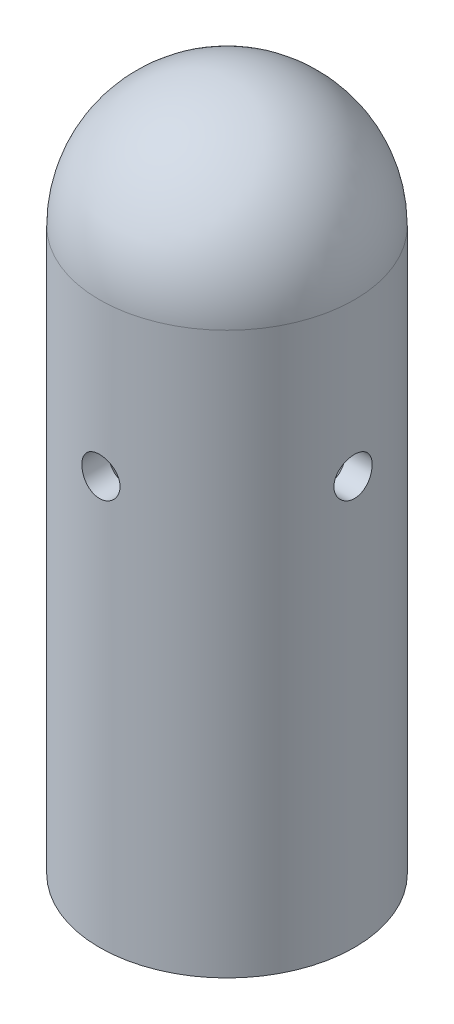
from build123d import *

# Parameters (mm, degrees)
SHELL1_T                = 10
CUT_EXTRUDE1_DEPTH      = 280.105714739
CUT_EXTRUDE1_DEPTH_BACK = 280.105714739
SKETCH2_R               = 7.5
CUT_EXTRUDE2_DEPTH      = 280.105714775
CUT_EXTRUDE2_DEPTH_BACK = 280.105714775
SKETCH3_R               = 7.5


with BuildPart() as part:
    # Sketch1 → Revolve1 (revolve)
    with BuildSketch(Plane.XY, mode=Mode.PRIVATE) as revolve1_sk:
        with BuildLine():
            Line((0, 0), (50, 0))
            Line((50, 0), (50, 70))
            Line((50, 70), (50, 220))
            ThreePointArc((50, 220), (35.355339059, 255.355339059), (0, 270))
            Line((0, 270), (0, 70))
            Line((0, 70), (0, 0))
        make_face()
    revolve(revolve1_sk.sketch.rotate(Axis((0, 70, 0), (0, 1, 0)), 90), axis=Axis((0, 70, 0), (0, 1, 0)))

    # Shell1 (no face opened: a closed hollow body)
    add(offset(amount=-SHELL1_T, mode=Mode.PRIVATE), mode=Mode.SUBTRACT)

    # Sketch2 → Cut-Extrude1 (cut, two sides: drawn at the far end of the back side and taken through both)
    with BuildSketch(Plane.XY.offset(-CUT_EXTRUDE1_DEPTH_BACK)):
        with Locations((0, 160)):
            Circle(SKETCH2_R)
    extrude(amount=CUT_EXTRUDE1_DEPTH + CUT_EXTRUDE1_DEPTH_BACK, mode=Mode.SUBTRACT)

    # Sketch3 → Cut-Extrude2 (cut, two sides: drawn at the far end of the back side and taken through both)
    with BuildSketch(Plane(origin=(0, 0, 0), x_dir=(0, 0, -1), z_dir=(1, 0, 0)).offset(-CUT_EXTRUDE2_DEPTH_BACK)):
        with Locations((0, 160)):
            Circle(SKETCH3_R)
    extrude(amount=CUT_EXTRUDE2_DEPTH + CUT_EXTRUDE2_DEPTH_BACK, mode=Mode.SUBTRACT)


solid = part.part
